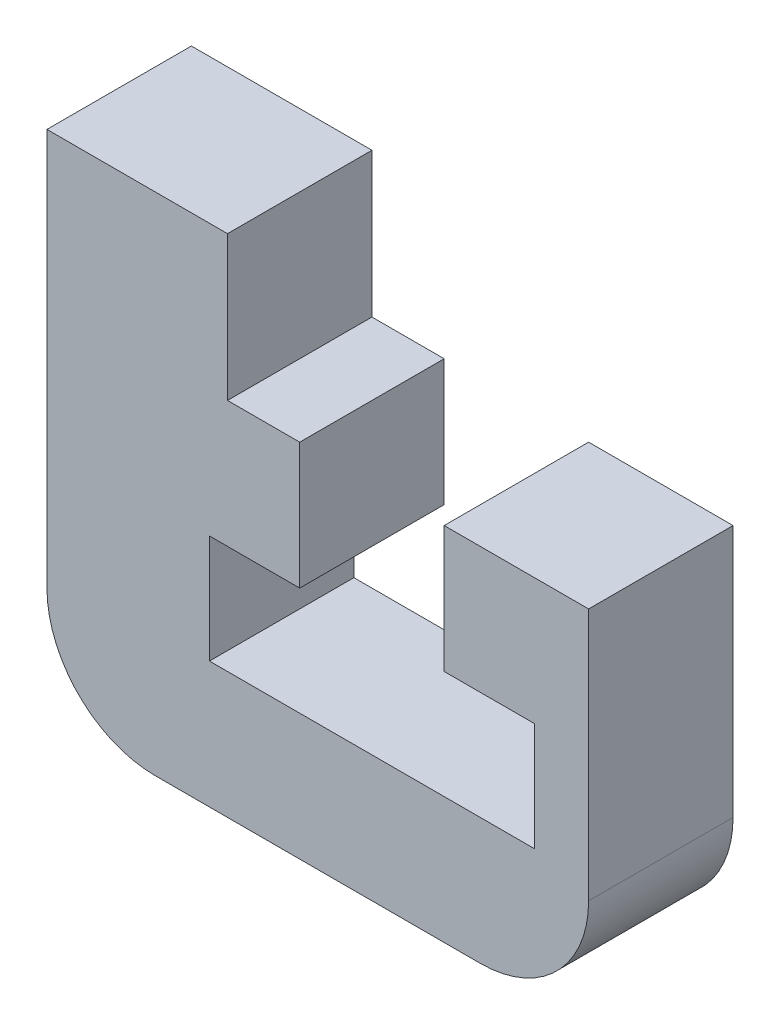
from build123d import *

# Parameters (mm, degrees)
SALIENTE_EXTRUIR1_DEPTH = 4


with BuildPart() as part:
    # Croquis1 → Saliente-Extruir1 (new body)
    with BuildSketch(Plane.XY):
        with BuildLine():
            Line((0, 23.001027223), (-5, 23.001027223))
            Line((-5, 23.001027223), (-5, 12.001027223))
            ThreePointArc((-5, 12.001027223), (-4.121320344, 9.87970688), (-2, 9.001027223))
            Line((-2, 9.001027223), (7, 9.001027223))
            ThreePointArc((7, 9.001027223), (9.121320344, 9.87970688), (10, 12.001027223))
            Line((10, 12.001027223), (10, 19.001027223))
            Line((10, 19.001027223), (6, 19.001027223))
            Line((6, 19.001027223), (6, 15.501027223))
            Line((6, 15.501027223), (8.5, 15.501027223))
            Line((8.5, 15.501027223), (8.5, 12.501027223))
            Line((8.5, 12.501027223), (-0.5, 12.501027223))
            Line((-0.5, 12.501027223), (-0.5, 15.501027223))
            Line((-0.5, 15.501027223), (2, 15.501027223))
            Line((2, 15.501027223), (2, 19.001027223))
            Line((2, 19.001027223), (0, 19.001027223))
            Line((0, 19.001027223), (0, 23.001027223))
        make_face()
    extrude(amount=SALIENTE_EXTRUIR1_DEPTH)


solid = part.part
